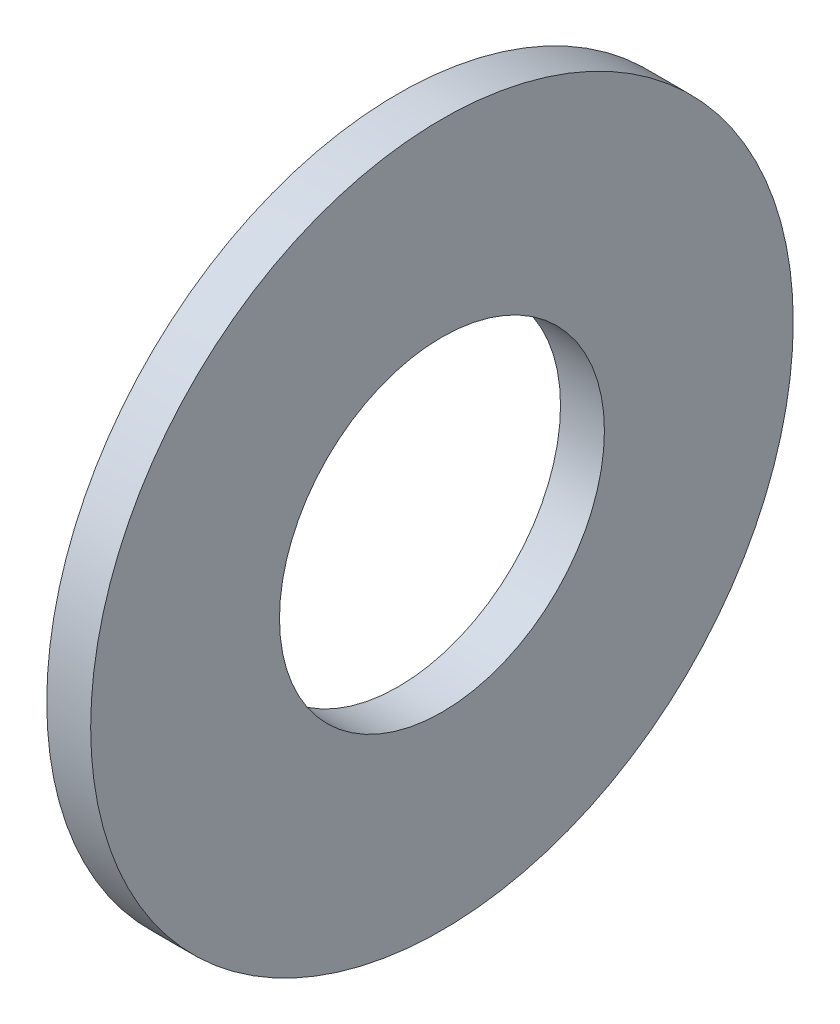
from build123d import *

# Parameters (mm, degrees)
SKETCH1_W = 0.5
SKETCH1_H = 2.15


with BuildPart() as part:
    # Sketch1 → Base-Revolve (revolve)
    with BuildSketch(Plane.XY, mode=Mode.PRIVATE) as base_revolve_sk:
        with Locations((-0.25, 2.925)):
            Rectangle(SKETCH1_W, SKETCH1_H)
    revolve(base_revolve_sk.sketch.rotate(Axis((-34.925, 0, 0), (1, 0, 0)), 90), axis=Axis((-34.925, 0, 0), (1, 0, 0)))


solid = part.part
